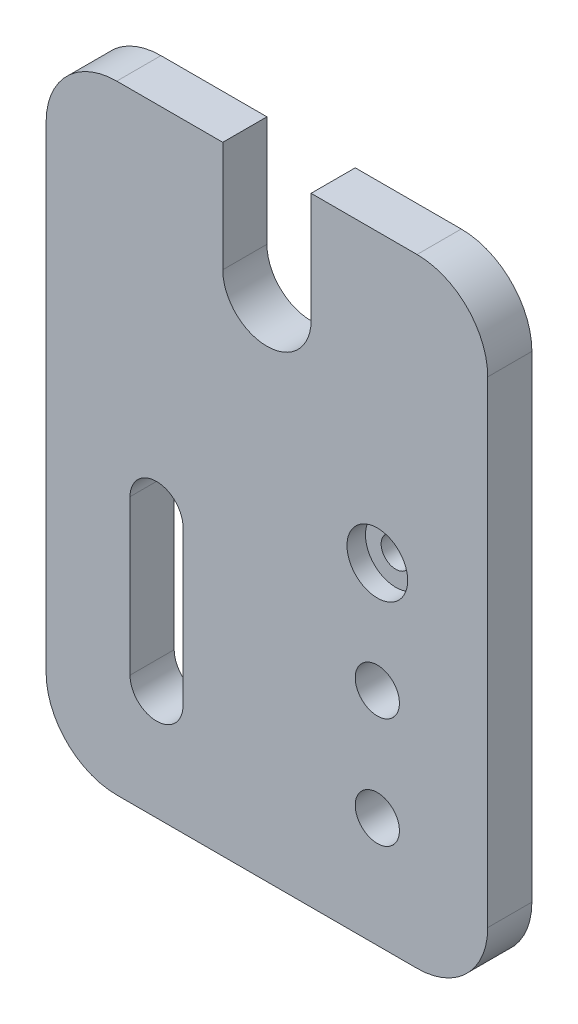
from build123d import *

# Parameters (mm, degrees)
SKETCH1_W                                            = 127
SKETCH1_H                                            = 177.8
EXTRUDE1_DEPTH                                       = 6.35
FILLET1_R                                            = 20.32
CUT_EXTRUDE1_DEPTH                                   = 110.985226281
SKETCH5_R                                            = 6.35
CUT_EXTRUDE2_DEPTH                                   = 110.985226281
CBORE_FOR_5_16_BINDING_HEAD_MACHINE_SCRE_D           = 8.4328
CBORE_FOR_5_16_BINDING_HEAD_MACHINE_SCRE_DEPTH       = 25.4
CBORE_FOR_5_16_BINDING_HEAD_MACHINE_SCRE_CBORE_D     = 17.4625
CBORE_FOR_5_16_BINDING_HEAD_MACHINE_SCRE_CBORE_DEPTH = 5.3086
CBORE_FOR_5_16_BINDING_HEAD_MACHINE_SCRE_TIP         = 2.533468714
CUT_EXTRUDE3_DEPTH                                   = 110.985226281


with BuildPart() as part:
    # Sketch1 → Extrude1 (new, symmetric)
    with BuildSketch(Plane.XY):
        Rectangle(SKETCH1_W, SKETCH1_H)
    extrude(amount=EXTRUDE1_DEPTH, both=True)

    # Fillet1
    fillet1_edges = [part.edges().sort_by_distance(p)[0] for p in [
        (-63.5, 88.9, 0),
        (63.5, 88.9, 0),
        (-63.5, -88.9, 0),
        (63.5, -88.9, 0),
    ]]
    fillet(fillet1_edges, radius=FILLET1_R)

    # Sketch2 → Cut-Extrude1 (cut, through all)
    with BuildSketch(Plane.XY.offset(6.35)):
        with BuildLine():
            Line((-12.7, 88.9), (-12.7, 57.15))
            ThreePointArc((-12.7, 57.15), (0, 44.45), (12.7, 57.15))
            Line((12.7, 57.15), (12.7, 88.9))
            Line((12.7, 88.9), (-12.7, 88.9))
        make_face()
    extrude(amount=-CUT_EXTRUDE1_DEPTH, mode=Mode.SUBTRACT)

    # Sketch5 → Cut-Extrude2 (cut, through all)
    with BuildSketch(Plane.XY.offset(6.35)):
        with Locations((31.75, -25.4)):
            Circle(SKETCH5_R)
        with Locations((31.75, -57.15)):
            Circle(SKETCH5_R)
    extrude(amount=-CUT_EXTRUDE2_DEPTH, mode=Mode.SUBTRACT)

    # CBORE for 5_16 Binding Head Machine Scre
    with Locations(Plane.XY.offset(6.35)):
        with Locations((31.75, 6.35)):
            CounterBoreHole(CBORE_FOR_5_16_BINDING_HEAD_MACHINE_SCRE_D / 2, CBORE_FOR_5_16_BINDING_HEAD_MACHINE_SCRE_CBORE_D / 2, CBORE_FOR_5_16_BINDING_HEAD_MACHINE_SCRE_CBORE_DEPTH, depth=CBORE_FOR_5_16_BINDING_HEAD_MACHINE_SCRE_DEPTH)
            with Locations((0, 0, -(CBORE_FOR_5_16_BINDING_HEAD_MACHINE_SCRE_DEPTH + CBORE_FOR_5_16_BINDING_HEAD_MACHINE_SCRE_TIP / 2))):  # 118° drill point
                Cone(0, CBORE_FOR_5_16_BINDING_HEAD_MACHINE_SCRE_D / 2, CBORE_FOR_5_16_BINDING_HEAD_MACHINE_SCRE_TIP, mode=Mode.SUBTRACT)

    # Sketch8 → Cut-Extrude3 (cut, through all)
    with BuildSketch(Plane.XY.offset(6.35)):
        with BuildLine():
            Line((-39.37, -12.7), (-39.37, -57.15))
            ThreePointArc((-39.37, -57.15), (-31.75, -64.77), (-24.13, -57.15))
            Line((-24.13, -57.15), (-24.13, -12.7))
            ThreePointArc((-24.13, -12.7), (-31.75, -5.08), (-39.37, -12.7))
        make_face()
    extrude(amount=-CUT_EXTRUDE3_DEPTH, mode=Mode.SUBTRACT)


solid = part.part
